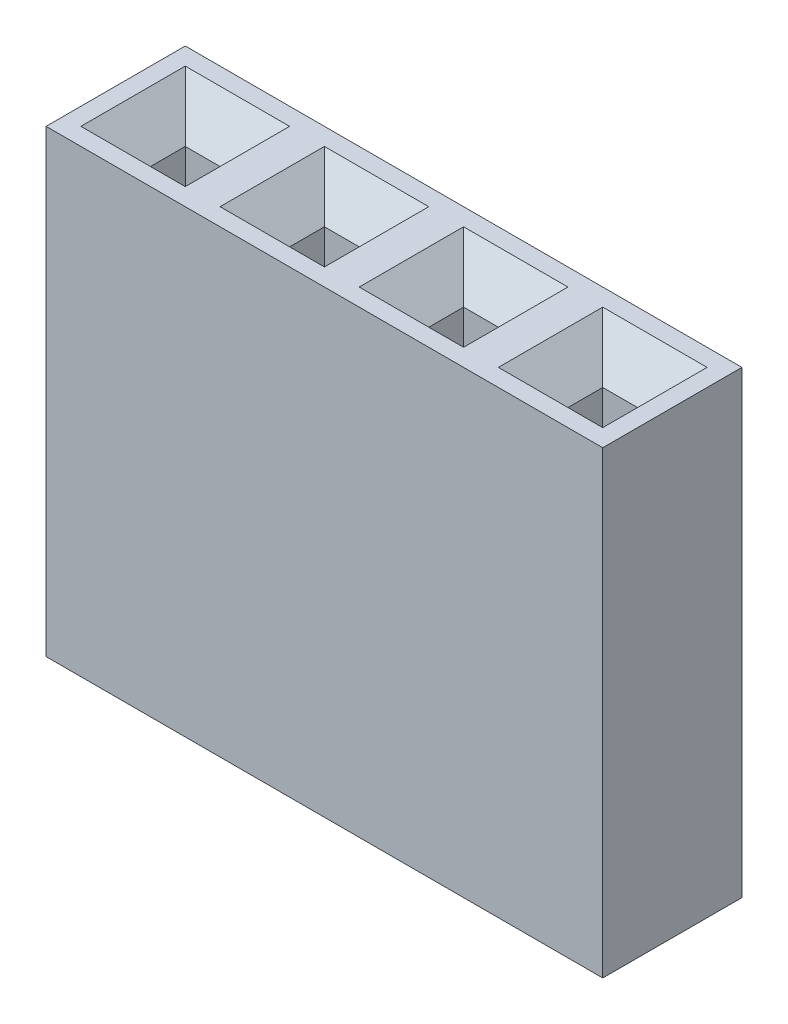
ISO-10303-21;
HEADER;
FILE_DESCRIPTION(('STEP AP214'),'2;1');
FILE_NAME('part.step','',(''),(''),'','','');
FILE_SCHEMA(('AUTOMOTIVE_DESIGN { 1 0 10303 214 1 1 1 1 }'));
ENDSEC;
DATA;
#1=APPLICATION_CONTEXT('core data for automotive mechanical design processes');
#2=APPLICATION_PROTOCOL_DEFINITION('international standard','automotive_design',2000,#1);
#3=PRODUCT_CONTEXT('',#1,'mechanical');
#4=PRODUCT('Part','Part','',(#3));
#5=PRODUCT_RELATED_PRODUCT_CATEGORY('part','',(#4));
#6=PRODUCT_DEFINITION_FORMATION('','',#4);
#7=PRODUCT_DEFINITION_CONTEXT('part definition',#1,'design');
#8=PRODUCT_DEFINITION('design','',#6,#7);
#9=PRODUCT_DEFINITION_SHAPE('','',#8);
#10=(LENGTH_UNIT() NAMED_UNIT(*) SI_UNIT(.MILLI.,.METRE.));
#11=(NAMED_UNIT(*) PLANE_ANGLE_UNIT() SI_UNIT($,.RADIAN.));
#12=(NAMED_UNIT(*) SI_UNIT($,.STERADIAN.) SOLID_ANGLE_UNIT());
#13=UNCERTAINTY_MEASURE_WITH_UNIT(LENGTH_MEASURE(1.E-05),#10,'distance_accuracy_value','');
#14=(GEOMETRIC_REPRESENTATION_CONTEXT(3) GLOBAL_UNCERTAINTY_ASSIGNED_CONTEXT((#13)) GLOBAL_UNIT_ASSIGNED_CONTEXT((#10,
#11,#12)) REPRESENTATION_CONTEXT('',''));
#15=CARTESIAN_POINT('',(0.,0.,0.));
#16=DIRECTION('',(0.,0.,1.));
#17=DIRECTION('',(1.,0.,0.));
#18=AXIS2_PLACEMENT_3D('',#15,#16,#17);
#19=CARTESIAN_POINT('',(-1.27,8.382,-1.27));
#20=DIRECTION('',(0.,-1.,0.));
#21=DIRECTION('',(0.,0.,-1.));
#22=AXIS2_PLACEMENT_3D('',#19,#20,#21);
#23=PLANE('',#22);
#24=DIRECTION('',(0.,0.,-1.));
#25=VECTOR('',#24,1.);
#26=CARTESIAN_POINT('',(-6.6675,8.382,0.9525));
#27=LINE('',#26,#25);
#28=CARTESIAN_POINT('',(-6.6675,8.382,0.9525));
#29=VERTEX_POINT('',#28);
#30=CARTESIAN_POINT('',(-6.6675,8.382,-0.9525));
#31=VERTEX_POINT('',#30);
#32=EDGE_CURVE('E67',#29,#31,#27,.T.);
#33=ORIENTED_EDGE('',*,*,#32,.F.);
#34=DIRECTION('',(1.,0.,0.));
#35=VECTOR('',#34,1.);
#36=CARTESIAN_POINT('',(-6.6675,8.382,0.9525));
#37=LINE('',#36,#35);
#38=CARTESIAN_POINT('',(-8.5725,8.382,0.9525));
#39=VERTEX_POINT('',#38);
#40=EDGE_CURVE('E260',#39,#29,#37,.T.);
#41=ORIENTED_EDGE('',*,*,#40,.F.);
#42=DIRECTION('',(0.,0.,1.));
#43=VECTOR('',#42,1.);
#44=CARTESIAN_POINT('',(-8.5725,8.382,0.9525));
#45=LINE('',#44,#43);
#46=CARTESIAN_POINT('',(-8.5725,8.382,-0.9525));
#47=VERTEX_POINT('',#46);
#48=EDGE_CURVE('E477',#47,#39,#45,.T.);
#49=ORIENTED_EDGE('',*,*,#48,.F.);
#50=DIRECTION('',(-1.,0.,0.));
#51=VECTOR('',#50,1.);
#52=CARTESIAN_POINT('',(-6.6675,8.382,-0.9525));
#53=LINE('',#52,#51);
#54=EDGE_CURVE('E358',#31,#47,#53,.T.);
#55=ORIENTED_EDGE('',*,*,#54,.F.);
#56=EDGE_LOOP('',(#33,#41,#49,#55));
#57=FACE_BOUND('',#56,.T.);
#58=DIRECTION('',(0.,0.,-1.));
#59=VECTOR('',#58,1.);
#60=CARTESIAN_POINT('',(-4.1275,8.382,0.9525));
#61=LINE('',#60,#59);
#62=CARTESIAN_POINT('',(-4.1275,8.382,0.9525));
#63=VERTEX_POINT('',#62);
#64=CARTESIAN_POINT('',(-4.1275,8.382,-0.9525));
#65=VERTEX_POINT('',#64);
#66=EDGE_CURVE('E530',#63,#65,#61,.T.);
#67=ORIENTED_EDGE('',*,*,#66,.F.);
#68=DIRECTION('',(1.,0.,0.));
#69=VECTOR('',#68,1.);
#70=CARTESIAN_POINT('',(-4.1275,8.382,0.9525));
#71=LINE('',#70,#69);
#72=CARTESIAN_POINT('',(-6.0325,8.382,0.9525));
#73=VERTEX_POINT('',#72);
#74=EDGE_CURVE('E584',#73,#63,#71,.T.);
#75=ORIENTED_EDGE('',*,*,#74,.F.);
#76=DIRECTION('',(0.,0.,1.));
#77=VECTOR('',#76,1.);
#78=CARTESIAN_POINT('',(-6.0325,8.382,0.9525));
#79=LINE('',#78,#77);
#80=CARTESIAN_POINT('',(-6.0325,8.382,-0.9525));
#81=VERTEX_POINT('',#80);
#82=EDGE_CURVE('E286',#81,#73,#79,.T.);
#83=ORIENTED_EDGE('',*,*,#82,.F.);
#84=DIRECTION('',(-1.,0.,0.));
#85=VECTOR('',#84,1.);
#86=CARTESIAN_POINT('',(-4.1275,8.382,-0.9525));
#87=LINE('',#86,#85);
#88=EDGE_CURVE('E604',#65,#81,#87,.T.);
#89=ORIENTED_EDGE('',*,*,#88,.F.);
#90=EDGE_LOOP('',(#67,#75,#83,#89));
#91=FACE_BOUND('',#90,.T.);
#92=DIRECTION('',(0.,0.,-1.));
#93=VECTOR('',#92,1.);
#94=CARTESIAN_POINT('',(-1.5875,8.382,0.9525));
#95=LINE('',#94,#93);
#96=CARTESIAN_POINT('',(-1.5875,8.382,0.9525));
#97=VERTEX_POINT('',#96);
#98=CARTESIAN_POINT('',(-1.5875,8.382,-0.9525));
#99=VERTEX_POINT('',#98);
#100=EDGE_CURVE('E737',#97,#99,#95,.T.);
#101=ORIENTED_EDGE('',*,*,#100,.F.);
#102=DIRECTION('',(1.,0.,0.));
#103=VECTOR('',#102,1.);
#104=CARTESIAN_POINT('',(-1.5875,8.382,0.9525));
#105=LINE('',#104,#103);
#106=CARTESIAN_POINT('',(-3.4925,8.382,0.9525));
#107=VERTEX_POINT('',#106);
#108=EDGE_CURVE('E788',#107,#97,#105,.T.);
#109=ORIENTED_EDGE('',*,*,#108,.F.);
#110=DIRECTION('',(0.,0.,1.));
#111=VECTOR('',#110,1.);
#112=CARTESIAN_POINT('',(-3.4925,8.382,0.9525));
#113=LINE('',#112,#111);
#114=CARTESIAN_POINT('',(-3.4925,8.382,-0.9525));
#115=VERTEX_POINT('',#114);
#116=EDGE_CURVE('E888',#115,#107,#113,.T.);
#117=ORIENTED_EDGE('',*,*,#116,.F.);
#118=DIRECTION('',(-1.,0.,0.));
#119=VECTOR('',#118,1.);
#120=CARTESIAN_POINT('',(-1.5875,8.382,-0.9525));
#121=LINE('',#120,#119);
#122=EDGE_CURVE('E808',#99,#115,#121,.T.);
#123=ORIENTED_EDGE('',*,*,#122,.F.);
#124=EDGE_LOOP('',(#101,#109,#117,#123));
#125=FACE_BOUND('',#124,.T.);
#126=DIRECTION('',(0.,0.,-1.));
#127=VECTOR('',#126,1.);
#128=CARTESIAN_POINT('',(0.9525,8.382,0.9525));
#129=LINE('',#128,#127);
#130=CARTESIAN_POINT('',(0.9525,8.382,0.9525));
#131=VERTEX_POINT('',#130);
#132=CARTESIAN_POINT('',(0.9525,8.382,-0.9525));
#133=VERTEX_POINT('',#132);
#134=EDGE_CURVE('E1049',#131,#133,#129,.T.);
#135=ORIENTED_EDGE('',*,*,#134,.F.);
#136=DIRECTION('',(1.,0.,0.));
#137=VECTOR('',#136,1.);
#138=CARTESIAN_POINT('',(0.9525,8.382,0.9525));
#139=LINE('',#138,#137);
#140=CARTESIAN_POINT('',(-0.9525,8.382,0.9525));
#141=VERTEX_POINT('',#140);
#142=EDGE_CURVE('E1057',#141,#131,#139,.T.);
#143=ORIENTED_EDGE('',*,*,#142,.F.);
#144=DIRECTION('',(0.,0.,1.));
#145=VECTOR('',#144,1.);
#146=CARTESIAN_POINT('',(-0.9525,8.382,0.9525));
#147=LINE('',#146,#145);
#148=CARTESIAN_POINT('',(-0.9525,8.382,-0.9525));
#149=VERTEX_POINT('',#148);
#150=EDGE_CURVE('E1051',#149,#141,#147,.T.);
#151=ORIENTED_EDGE('',*,*,#150,.F.);
#152=DIRECTION('',(-1.,0.,0.));
#153=VECTOR('',#152,1.);
#154=CARTESIAN_POINT('',(0.9525,8.382,-0.9525));
#155=LINE('',#154,#153);
#156=EDGE_CURVE('E1046',#133,#149,#155,.T.);
#157=ORIENTED_EDGE('',*,*,#156,.F.);
#158=EDGE_LOOP('',(#135,#143,#151,#157));
#159=FACE_BOUND('',#158,.T.);
#160=DIRECTION('',(-1.,0.,0.));
#161=VECTOR('',#160,1.);
#162=CARTESIAN_POINT('',(-1.27,8.382,-1.27));
#163=LINE('',#162,#161);
#164=CARTESIAN_POINT('',(1.27,8.382,-1.27));
#165=VERTEX_POINT('',#164);
#166=CARTESIAN_POINT('',(-8.89,8.382,-1.27));
#167=VERTEX_POINT('',#166);
#168=EDGE_CURVE('E956',#165,#167,#163,.T.);
#169=ORIENTED_EDGE('',*,*,#168,.T.);
#170=DIRECTION('',(0.,0.,1.));
#171=VECTOR('',#170,1.);
#172=CARTESIAN_POINT('',(-8.89,8.382,1.27));
#173=LINE('',#172,#171);
#174=CARTESIAN_POINT('',(-8.89,8.382,1.27));
#175=VERTEX_POINT('',#174);
#176=EDGE_CURVE('E313',#167,#175,#173,.T.);
#177=ORIENTED_EDGE('',*,*,#176,.T.);
#178=DIRECTION('',(1.,0.,0.));
#179=VECTOR('',#178,1.);
#180=CARTESIAN_POINT('',(-1.27,8.382,1.27));
#181=LINE('',#180,#179);
#182=CARTESIAN_POINT('',(1.27,8.382,1.27));
#183=VERTEX_POINT('',#182);
#184=EDGE_CURVE('E953',#175,#183,#181,.T.);
#185=ORIENTED_EDGE('',*,*,#184,.T.);
#186=DIRECTION('',(0.,0.,-1.));
#187=VECTOR('',#186,1.);
#188=CARTESIAN_POINT('',(1.27,8.382,1.27));
#189=LINE('',#188,#187);
#190=EDGE_CURVE('E960',#183,#165,#189,.T.);
#191=ORIENTED_EDGE('',*,*,#190,.T.);
#192=EDGE_LOOP('',(#169,#177,#185,#191));
#193=FACE_BOUND('',#192,.T.);
#194=ADVANCED_FACE('F63',(#57,#91,#125,#159,#193),#23,.F.);
#195=CARTESIAN_POINT('',(-1.27,0.,-1.27));
#196=DIRECTION('',(0.,-1.,0.));
#197=DIRECTION('',(0.,0.,-1.));
#198=AXIS2_PLACEMENT_3D('',#195,#196,#197);
#199=PLANE('',#198);
#200=DIRECTION('',(1.,0.,0.));
#201=VECTOR('',#200,1.);
#202=CARTESIAN_POINT('',(-1.27,0.,1.27));
#203=LINE('',#202,#201);
#204=CARTESIAN_POINT('',(-8.89,0.,1.27));
#205=VERTEX_POINT('',#204);
#206=CARTESIAN_POINT('',(1.27,0.,1.27));
#207=VERTEX_POINT('',#206);
#208=EDGE_CURVE('E925',#205,#207,#203,.T.);
#209=ORIENTED_EDGE('',*,*,#208,.F.);
#210=DIRECTION('',(0.,0.,1.));
#211=VECTOR('',#210,1.);
#212=CARTESIAN_POINT('',(-8.89,0.,1.27));
#213=LINE('',#212,#211);
#214=CARTESIAN_POINT('',(-8.89,0.,-1.27));
#215=VERTEX_POINT('',#214);
#216=EDGE_CURVE('E296',#215,#205,#213,.T.);
#217=ORIENTED_EDGE('',*,*,#216,.F.);
#218=DIRECTION('',(-1.,0.,0.));
#219=VECTOR('',#218,1.);
#220=CARTESIAN_POINT('',(-1.27,0.,-1.27));
#221=LINE('',#220,#219);
#222=CARTESIAN_POINT('',(1.27,0.,-1.27));
#223=VERTEX_POINT('',#222);
#224=EDGE_CURVE('E961',#223,#215,#221,.T.);
#225=ORIENTED_EDGE('',*,*,#224,.F.);
#226=DIRECTION('',(0.,0.,-1.));
#227=VECTOR('',#226,1.);
#228=CARTESIAN_POINT('',(1.27,0.,1.27));
#229=LINE('',#228,#227);
#230=EDGE_CURVE('E964',#207,#223,#229,.T.);
#231=ORIENTED_EDGE('',*,*,#230,.F.);
#232=EDGE_LOOP('',(#209,#217,#225,#231));
#233=FACE_BOUND('',#232,.T.);
#234=DIRECTION('',(-1.,0.,0.));
#235=VECTOR('',#234,1.);
#236=CARTESIAN_POINT('',(-0.3175,0.,-0.3175));
#237=LINE('',#236,#235);
#238=CARTESIAN_POINT('',(0.3175,0.,-0.3175));
#239=VERTEX_POINT('',#238);
#240=CARTESIAN_POINT('',(-0.3175,0.,-0.3175));
#241=VERTEX_POINT('',#240);
#242=EDGE_CURVE('E932',#239,#241,#237,.T.);
#243=ORIENTED_EDGE('',*,*,#242,.T.);
#244=DIRECTION('',(0.,0.,1.));
#245=VECTOR('',#244,1.);
#246=CARTESIAN_POINT('',(-0.3175,0.,0.3175));
#247=LINE('',#246,#245);
#248=CARTESIAN_POINT('',(-0.3175,0.,0.3175));
#249=VERTEX_POINT('',#248);
#250=EDGE_CURVE('E1069',#241,#249,#247,.T.);
#251=ORIENTED_EDGE('',*,*,#250,.T.);
#252=DIRECTION('',(1.,0.,0.));
#253=VECTOR('',#252,1.);
#254=CARTESIAN_POINT('',(-0.3175,0.,0.3175));
#255=LINE('',#254,#253);
#256=CARTESIAN_POINT('',(0.3175,0.,0.3175));
#257=VERTEX_POINT('',#256);
#258=EDGE_CURVE('E1071',#249,#257,#255,.T.);
#259=ORIENTED_EDGE('',*,*,#258,.T.);
#260=DIRECTION('',(0.,0.,-1.));
#261=VECTOR('',#260,1.);
#262=CARTESIAN_POINT('',(0.3175,0.,0.3175));
#263=LINE('',#262,#261);
#264=EDGE_CURVE('E1075',#257,#239,#263,.T.);
#265=ORIENTED_EDGE('',*,*,#264,.T.);
#266=EDGE_LOOP('',(#243,#251,#259,#265));
#267=FACE_BOUND('',#266,.T.);
#268=DIRECTION('',(-1.,0.,0.));
#269=VECTOR('',#268,1.);
#270=CARTESIAN_POINT('',(-2.8575,0.,-0.3175));
#271=LINE('',#270,#269);
#272=CARTESIAN_POINT('',(-2.2225,0.,-0.3175));
#273=VERTEX_POINT('',#272);
#274=CARTESIAN_POINT('',(-2.8575,0.,-0.3175));
#275=VERTEX_POINT('',#274);
#276=EDGE_CURVE('E824',#273,#275,#271,.T.);
#277=ORIENTED_EDGE('',*,*,#276,.T.);
#278=DIRECTION('',(0.,0.,1.));
#279=VECTOR('',#278,1.);
#280=CARTESIAN_POINT('',(-2.8575,0.,0.3175));
#281=LINE('',#280,#279);
#282=CARTESIAN_POINT('',(-2.8575,0.,0.3175));
#283=VERTEX_POINT('',#282);
#284=EDGE_CURVE('E822',#275,#283,#281,.T.);
#285=ORIENTED_EDGE('',*,*,#284,.T.);
#286=DIRECTION('',(1.,0.,0.));
#287=VECTOR('',#286,1.);
#288=CARTESIAN_POINT('',(-2.8575,0.,0.3175));
#289=LINE('',#288,#287);
#290=CARTESIAN_POINT('',(-2.2225,0.,0.3175));
#291=VERTEX_POINT('',#290);
#292=EDGE_CURVE('E1555',#283,#291,#289,.T.);
#293=ORIENTED_EDGE('',*,*,#292,.T.);
#294=DIRECTION('',(0.,0.,-1.));
#295=VECTOR('',#294,1.);
#296=CARTESIAN_POINT('',(-2.2225,0.,0.3175));
#297=LINE('',#296,#295);
#298=EDGE_CURVE('E827',#291,#273,#297,.T.);
#299=ORIENTED_EDGE('',*,*,#298,.T.);
#300=EDGE_LOOP('',(#277,#285,#293,#299));
#301=FACE_BOUND('',#300,.T.);
#302=DIRECTION('',(-1.,0.,0.));
#303=VECTOR('',#302,1.);
#304=CARTESIAN_POINT('',(-5.3975,0.,-0.3175));
#305=LINE('',#304,#303);
#306=CARTESIAN_POINT('',(-4.7625,0.,-0.3175));
#307=VERTEX_POINT('',#306);
#308=CARTESIAN_POINT('',(-5.3975,0.,-0.3175));
#309=VERTEX_POINT('',#308);
#310=EDGE_CURVE('E620',#307,#309,#305,.T.);
#311=ORIENTED_EDGE('',*,*,#310,.T.);
#312=DIRECTION('',(0.,0.,1.));
#313=VECTOR('',#312,1.);
#314=CARTESIAN_POINT('',(-5.3975,0.,0.3175));
#315=LINE('',#314,#313);
#316=CARTESIAN_POINT('',(-5.3975,0.,0.3175));
#317=VERTEX_POINT('',#316);
#318=EDGE_CURVE('E618',#309,#317,#315,.T.);
#319=ORIENTED_EDGE('',*,*,#318,.T.);
#320=DIRECTION('',(1.,0.,0.));
#321=VECTOR('',#320,1.);
#322=CARTESIAN_POINT('',(-5.3975,0.,0.3175));
#323=LINE('',#322,#321);
#324=CARTESIAN_POINT('',(-4.7625,0.,0.3175));
#325=VERTEX_POINT('',#324);
#326=EDGE_CURVE('E939',#317,#325,#323,.T.);
#327=ORIENTED_EDGE('',*,*,#326,.T.);
#328=DIRECTION('',(0.,0.,-1.));
#329=VECTOR('',#328,1.);
#330=CARTESIAN_POINT('',(-4.7625,0.,0.3175));
#331=LINE('',#330,#329);
#332=EDGE_CURVE('E623',#325,#307,#331,.T.);
#333=ORIENTED_EDGE('',*,*,#332,.T.);
#334=EDGE_LOOP('',(#311,#319,#327,#333));
#335=FACE_BOUND('',#334,.T.);
#336=DIRECTION('',(-1.,0.,0.));
#337=VECTOR('',#336,1.);
#338=CARTESIAN_POINT('',(-7.9375,0.,-0.3175));
#339=LINE('',#338,#337);
#340=CARTESIAN_POINT('',(-7.3025,0.,-0.3175));
#341=VERTEX_POINT('',#340);
#342=CARTESIAN_POINT('',(-7.9375,0.,-0.3175));
#343=VERTEX_POINT('',#342);
#344=EDGE_CURVE('E906',#341,#343,#339,.T.);
#345=ORIENTED_EDGE('',*,*,#344,.T.);
#346=DIRECTION('',(0.,0.,1.));
#347=VECTOR('',#346,1.);
#348=CARTESIAN_POINT('',(-7.9375,0.,0.3175));
#349=LINE('',#348,#347);
#350=CARTESIAN_POINT('',(-7.9375,0.,0.3175));
#351=VERTEX_POINT('',#350);
#352=EDGE_CURVE('E900',#343,#351,#349,.T.);
#353=ORIENTED_EDGE('',*,*,#352,.T.);
#354=DIRECTION('',(1.,0.,0.));
#355=VECTOR('',#354,1.);
#356=CARTESIAN_POINT('',(-7.9375,0.,0.3175));
#357=LINE('',#356,#355);
#358=CARTESIAN_POINT('',(-7.3025,0.,0.3175));
#359=VERTEX_POINT('',#358);
#360=EDGE_CURVE('E903',#351,#359,#357,.T.);
#361=ORIENTED_EDGE('',*,*,#360,.T.);
#362=DIRECTION('',(0.,0.,-1.));
#363=VECTOR('',#362,1.);
#364=CARTESIAN_POINT('',(-7.3025,0.,0.3175));
#365=LINE('',#364,#363);
#366=EDGE_CURVE('E292',#359,#341,#365,.T.);
#367=ORIENTED_EDGE('',*,*,#366,.T.);
#368=EDGE_LOOP('',(#345,#353,#361,#367));
#369=FACE_BOUND('',#368,.T.);
#370=ADVANCED_FACE('F373',(#233,#267,#301,#335,#369),#199,.T.);
#371=CARTESIAN_POINT('',(-1.27,8.382,1.27));
#372=DIRECTION('',(0.,0.,-1.));
#373=DIRECTION('',(-1.,0.,0.));
#374=AXIS2_PLACEMENT_3D('',#371,#372,#373);
#375=PLANE('',#374);
#376=ORIENTED_EDGE('',*,*,#208,.T.);
#377=DIRECTION('',(0.,-1.,0.));
#378=VECTOR('',#377,1.);
#379=CARTESIAN_POINT('',(1.27,8.382,1.27));
#380=LINE('',#379,#378);
#381=EDGE_CURVE('E12',#183,#207,#380,.T.);
#382=ORIENTED_EDGE('',*,*,#381,.F.);
#383=ORIENTED_EDGE('',*,*,#184,.F.);
#384=DIRECTION('',(0.,-1.,0.));
#385=VECTOR('',#384,1.);
#386=CARTESIAN_POINT('',(-8.89,8.382,1.27));
#387=LINE('',#386,#385);
#388=EDGE_CURVE('E943',#175,#205,#387,.T.);
#389=ORIENTED_EDGE('',*,*,#388,.T.);
#390=EDGE_LOOP('',(#376,#382,#383,#389));
#391=FACE_BOUND('',#390,.T.);
#392=ADVANCED_FACE('F65',(#391),#375,.F.);
#393=CARTESIAN_POINT('',(1.27,8.382,1.27));
#394=DIRECTION('',(-1.,0.,0.));
#395=DIRECTION('',(0.,0.,1.));
#396=AXIS2_PLACEMENT_3D('',#393,#394,#395);
#397=PLANE('',#396);
#398=ORIENTED_EDGE('',*,*,#230,.T.);
#399=DIRECTION('',(0.,-1.,0.));
#400=VECTOR('',#399,1.);
#401=CARTESIAN_POINT('',(1.27,8.382,-1.27));
#402=LINE('',#401,#400);
#403=EDGE_CURVE('E73',#165,#223,#402,.T.);
#404=ORIENTED_EDGE('',*,*,#403,.F.);
#405=ORIENTED_EDGE('',*,*,#190,.F.);
#406=ORIENTED_EDGE('',*,*,#381,.T.);
#407=EDGE_LOOP('',(#398,#404,#405,#406));
#408=FACE_BOUND('',#407,.T.);
#409=ADVANCED_FACE('F920',(#408),#397,.F.);
#410=CARTESIAN_POINT('',(-1.27,8.382,-1.27));
#411=DIRECTION('',(0.,0.,1.));
#412=DIRECTION('',(1.,0.,0.));
#413=AXIS2_PLACEMENT_3D('',#410,#411,#412);
#414=PLANE('',#413);
#415=ORIENTED_EDGE('',*,*,#224,.T.);
#416=DIRECTION('',(0.,-1.,0.));
#417=VECTOR('',#416,1.);
#418=CARTESIAN_POINT('',(-8.89,8.382,-1.27));
#419=LINE('',#418,#417);
#420=EDGE_CURVE('E945',#167,#215,#419,.T.);
#421=ORIENTED_EDGE('',*,*,#420,.F.);
#422=ORIENTED_EDGE('',*,*,#168,.F.);
#423=ORIENTED_EDGE('',*,*,#403,.T.);
#424=EDGE_LOOP('',(#415,#421,#422,#423));
#425=FACE_BOUND('',#424,.T.);
#426=ADVANCED_FACE('F1233',(#425),#414,.F.);
#427=CARTESIAN_POINT('',(-0.3175,8.382,0.3175));
#428=DIRECTION('',(1.,0.,0.));
#429=DIRECTION('',(0.,0.,-1.));
#430=AXIS2_PLACEMENT_3D('',#427,#428,#429);
#431=PLANE('',#430);
#432=DIRECTION('',(0.,0.,1.));
#433=VECTOR('',#432,1.);
#434=CARTESIAN_POINT('',(-0.3175,7.747,0.3175));
#435=LINE('',#434,#433);
#436=CARTESIAN_POINT('',(-0.3175,7.747,-0.3175));
#437=VERTEX_POINT('',#436);
#438=CARTESIAN_POINT('',(-0.3175,7.747,0.3175));
#439=VERTEX_POINT('',#438);
#440=EDGE_CURVE('E1034',#437,#439,#435,.T.);
#441=ORIENTED_EDGE('',*,*,#440,.T.);
#442=DIRECTION('',(0.,-1.,0.));
#443=VECTOR('',#442,1.);
#444=CARTESIAN_POINT('',(-0.3175,8.382,0.3175));
#445=LINE('',#444,#443);
#446=EDGE_CURVE('E972',#439,#249,#445,.T.);
#447=ORIENTED_EDGE('',*,*,#446,.T.);
#448=ORIENTED_EDGE('',*,*,#250,.F.);
#449=DIRECTION('',(0.,-1.,0.));
#450=VECTOR('',#449,1.);
#451=CARTESIAN_POINT('',(-0.3175,8.382,-0.3175));
#452=LINE('',#451,#450);
#453=EDGE_CURVE('E980',#437,#241,#452,.T.);
#454=ORIENTED_EDGE('',*,*,#453,.F.);
#455=EDGE_LOOP('',(#441,#447,#448,#454));
#456=FACE_BOUND('',#455,.T.);
#457=ADVANCED_FACE('F374',(#456),#431,.T.);
#458=CARTESIAN_POINT('',(-0.3175,8.382,0.3175));
#459=DIRECTION('',(0.,0.,-1.));
#460=DIRECTION('',(-1.,0.,0.));
#461=AXIS2_PLACEMENT_3D('',#458,#459,#460);
#462=PLANE('',#461);
#463=DIRECTION('',(1.,0.,0.));
#464=VECTOR('',#463,1.);
#465=CARTESIAN_POINT('',(0.3175,7.747,0.3175));
#466=LINE('',#465,#464);
#467=CARTESIAN_POINT('',(0.3175,7.747,0.3175));
#468=VERTEX_POINT('',#467);
#469=EDGE_CURVE('E1072',#439,#468,#466,.T.);
#470=ORIENTED_EDGE('',*,*,#469,.T.);
#471=DIRECTION('',(0.,-1.,0.));
#472=VECTOR('',#471,1.);
#473=CARTESIAN_POINT('',(0.3175,8.382,0.3175));
#474=LINE('',#473,#472);
#475=EDGE_CURVE('E979',#468,#257,#474,.T.);
#476=ORIENTED_EDGE('',*,*,#475,.T.);
#477=ORIENTED_EDGE('',*,*,#258,.F.);
#478=ORIENTED_EDGE('',*,*,#446,.F.);
#479=EDGE_LOOP('',(#470,#476,#477,#478));
#480=FACE_BOUND('',#479,.T.);
#481=ADVANCED_FACE('F1014',(#480),#462,.T.);
#482=CARTESIAN_POINT('',(0.3175,8.382,0.3175));
#483=DIRECTION('',(-1.,0.,0.));
#484=DIRECTION('',(0.,0.,1.));
#485=AXIS2_PLACEMENT_3D('',#482,#483,#484);
#486=PLANE('',#485);
#487=DIRECTION('',(0.,0.,-1.));
#488=VECTOR('',#487,1.);
#489=CARTESIAN_POINT('',(0.3175,7.747,0.3175));
#490=LINE('',#489,#488);
#491=CARTESIAN_POINT('',(0.3175,7.747,-0.3175));
#492=VERTEX_POINT('',#491);
#493=EDGE_CURVE('E998',#468,#492,#490,.T.);
#494=ORIENTED_EDGE('',*,*,#493,.T.);
#495=DIRECTION('',(0.,-1.,0.));
#496=VECTOR('',#495,1.);
#497=CARTESIAN_POINT('',(0.3175,8.382,-0.3175));
#498=LINE('',#497,#496);
#499=EDGE_CURVE('E976',#492,#239,#498,.T.);
#500=ORIENTED_EDGE('',*,*,#499,.T.);
#501=ORIENTED_EDGE('',*,*,#264,.F.);
#502=ORIENTED_EDGE('',*,*,#475,.F.);
#503=EDGE_LOOP('',(#494,#500,#501,#502));
#504=FACE_BOUND('',#503,.T.);
#505=ADVANCED_FACE('F1005',(#504),#486,.T.);
#506=CARTESIAN_POINT('',(-0.3175,8.382,-0.3175));
#507=DIRECTION('',(0.,0.,1.));
#508=DIRECTION('',(1.,0.,0.));
#509=AXIS2_PLACEMENT_3D('',#506,#507,#508);
#510=PLANE('',#509);
#511=DIRECTION('',(-1.,0.,0.));
#512=VECTOR('',#511,1.);
#513=CARTESIAN_POINT('',(0.3175,7.747,-0.3175));
#514=LINE('',#513,#512);
#515=EDGE_CURVE('E1080',#492,#437,#514,.T.);
#516=ORIENTED_EDGE('',*,*,#515,.T.);
#517=ORIENTED_EDGE('',*,*,#453,.T.);
#518=ORIENTED_EDGE('',*,*,#242,.F.);
#519=ORIENTED_EDGE('',*,*,#499,.F.);
#520=EDGE_LOOP('',(#516,#517,#518,#519));
#521=FACE_BOUND('',#520,.T.);
#522=ADVANCED_FACE('F1013',(#521),#510,.T.);
#523=CARTESIAN_POINT('',(0.,7.4295,0.));
#524=DIRECTION('',(0.,-0.707106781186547,0.707106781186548));
#525=DIRECTION('',(0.,-0.707106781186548,-0.707106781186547));
#526=AXIS2_PLACEMENT_3D('',#523,#524,#525);
#527=PLANE('',#526);
#528=DIRECTION('',(0.577350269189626,0.577350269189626,0.577350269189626));
#529=VECTOR('',#528,1.);
#530=CARTESIAN_POINT('',(0.3175,7.747,0.3175));
#531=LINE('',#530,#529);
#532=EDGE_CURVE('E1101',#468,#131,#531,.T.);
#533=ORIENTED_EDGE('',*,*,#532,.F.);
#534=ORIENTED_EDGE('',*,*,#469,.F.);
#535=DIRECTION('',(-0.577350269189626,0.577350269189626,0.577350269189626));
#536=VECTOR('',#535,1.);
#537=CARTESIAN_POINT('',(-0.3175,7.747,0.3175));
#538=LINE('',#537,#536);
#539=EDGE_CURVE('E1100',#439,#141,#538,.T.);
#540=ORIENTED_EDGE('',*,*,#539,.T.);
#541=ORIENTED_EDGE('',*,*,#142,.T.);
#542=EDGE_LOOP('',(#533,#534,#540,#541));
#543=FACE_BOUND('',#542,.T.);
#544=ADVANCED_FACE('F1173',(#543),#527,.F.);
#545=CARTESIAN_POINT('',(0.,7.4295,0.));
#546=DIRECTION('',(-0.707106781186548,-0.707106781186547,0.));
#547=DIRECTION('',(0.707106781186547,-0.707106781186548,0.));
#548=AXIS2_PLACEMENT_3D('',#545,#546,#547);
#549=PLANE('',#548);
#550=ORIENTED_EDGE('',*,*,#539,.F.);
#551=ORIENTED_EDGE('',*,*,#440,.F.);
#552=DIRECTION('',(-0.577350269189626,0.577350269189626,-0.577350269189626));
#553=VECTOR('',#552,1.);
#554=CARTESIAN_POINT('',(-0.3175,7.747,-0.3175));
#555=LINE('',#554,#553);
#556=EDGE_CURVE('E1153',#437,#149,#555,.T.);
#557=ORIENTED_EDGE('',*,*,#556,.T.);
#558=ORIENTED_EDGE('',*,*,#150,.T.);
#559=EDGE_LOOP('',(#550,#551,#557,#558));
#560=FACE_BOUND('',#559,.T.);
#561=ADVANCED_FACE('F1130',(#560),#549,.F.);
#562=CARTESIAN_POINT('',(0.,7.4295,0.));
#563=DIRECTION('',(0.707106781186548,-0.707106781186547,0.));
#564=DIRECTION('',(0.707106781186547,0.707106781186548,0.));
#565=AXIS2_PLACEMENT_3D('',#562,#563,#564);
#566=PLANE('',#565);
#567=DIRECTION('',(0.577350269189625,0.577350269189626,-0.577350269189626));
#568=VECTOR('',#567,1.);
#569=CARTESIAN_POINT('',(0.3175,7.747,-0.3175));
#570=LINE('',#569,#568);
#571=EDGE_CURVE('E1104',#492,#133,#570,.T.);
#572=ORIENTED_EDGE('',*,*,#571,.F.);
#573=ORIENTED_EDGE('',*,*,#493,.F.);
#574=ORIENTED_EDGE('',*,*,#532,.T.);
#575=ORIENTED_EDGE('',*,*,#134,.T.);
#576=EDGE_LOOP('',(#572,#573,#574,#575));
#577=FACE_BOUND('',#576,.T.);
#578=ADVANCED_FACE('F1121',(#577),#566,.F.);
#579=CARTESIAN_POINT('',(0.,7.4295,0.));
#580=DIRECTION('',(0.,-0.707106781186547,-0.707106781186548));
#581=DIRECTION('',(0.,0.707106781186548,-0.707106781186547));
#582=AXIS2_PLACEMENT_3D('',#579,#580,#581);
#583=PLANE('',#582);
#584=ORIENTED_EDGE('',*,*,#556,.F.);
#585=ORIENTED_EDGE('',*,*,#515,.F.);
#586=ORIENTED_EDGE('',*,*,#571,.T.);
#587=ORIENTED_EDGE('',*,*,#156,.T.);
#588=EDGE_LOOP('',(#584,#585,#586,#587));
#589=FACE_BOUND('',#588,.T.);
#590=ADVANCED_FACE('F1129',(#589),#583,.F.);
#591=CARTESIAN_POINT('',(-2.8575,8.382,0.3175));
#592=DIRECTION('',(1.,0.,0.));
#593=DIRECTION('',(0.,0.,-1.));
#594=AXIS2_PLACEMENT_3D('',#591,#592,#593);
#595=PLANE('',#594);
#596=DIRECTION('',(0.,0.,1.));
#597=VECTOR('',#596,1.);
#598=CARTESIAN_POINT('',(-2.8575,7.747,0.3175));
#599=LINE('',#598,#597);
#600=CARTESIAN_POINT('',(-2.8575,7.747,-0.3175));
#601=VERTEX_POINT('',#600);
#602=CARTESIAN_POINT('',(-2.8575,7.747,0.3175));
#603=VERTEX_POINT('',#602);
#604=EDGE_CURVE('E793',#601,#603,#599,.T.);
#605=ORIENTED_EDGE('',*,*,#604,.T.);
#606=DIRECTION('',(0.,-1.,0.));
#607=VECTOR('',#606,1.);
#608=CARTESIAN_POINT('',(-2.8575,8.382,0.3175));
#609=LINE('',#608,#607);
#610=EDGE_CURVE('E842',#603,#283,#609,.T.);
#611=ORIENTED_EDGE('',*,*,#610,.T.);
#612=ORIENTED_EDGE('',*,*,#284,.F.);
#613=DIRECTION('',(0.,-1.,0.));
#614=VECTOR('',#613,1.);
#615=CARTESIAN_POINT('',(-2.8575,8.382,-0.3175));
#616=LINE('',#615,#614);
#617=EDGE_CURVE('E814',#601,#275,#616,.T.);
#618=ORIENTED_EDGE('',*,*,#617,.F.);
#619=EDGE_LOOP('',(#605,#611,#612,#618));
#620=FACE_BOUND('',#619,.T.);
#621=ADVANCED_FACE('F820',(#620),#595,.T.);
#622=CARTESIAN_POINT('',(-2.8575,8.382,0.3175));
#623=DIRECTION('',(0.,0.,-1.));
#624=DIRECTION('',(-1.,0.,0.));
#625=AXIS2_PLACEMENT_3D('',#622,#623,#624);
#626=PLANE('',#625);
#627=DIRECTION('',(1.,0.,0.));
#628=VECTOR('',#627,1.);
#629=CARTESIAN_POINT('',(-2.2225,7.747,0.3175));
#630=LINE('',#629,#628);
#631=CARTESIAN_POINT('',(-2.2225,7.747,0.3175));
#632=VERTEX_POINT('',#631);
#633=EDGE_CURVE('E701',#603,#632,#630,.T.);
#634=ORIENTED_EDGE('',*,*,#633,.T.);
#635=DIRECTION('',(0.,-1.,0.));
#636=VECTOR('',#635,1.);
#637=CARTESIAN_POINT('',(-2.2225,8.382,0.3175));
#638=LINE('',#637,#636);
#639=EDGE_CURVE('E825',#632,#291,#638,.T.);
#640=ORIENTED_EDGE('',*,*,#639,.T.);
#641=ORIENTED_EDGE('',*,*,#292,.F.);
#642=ORIENTED_EDGE('',*,*,#610,.F.);
#643=EDGE_LOOP('',(#634,#640,#641,#642));
#644=FACE_BOUND('',#643,.T.);
#645=ADVANCED_FACE('F862',(#644),#626,.T.);
#646=CARTESIAN_POINT('',(-2.2225,8.382,0.3175));
#647=DIRECTION('',(-1.,0.,0.));
#648=DIRECTION('',(0.,0.,1.));
#649=AXIS2_PLACEMENT_3D('',#646,#647,#648);
#650=PLANE('',#649);
#651=DIRECTION('',(0.,0.,-1.));
#652=VECTOR('',#651,1.);
#653=CARTESIAN_POINT('',(-2.2225,7.747,0.3175));
#654=LINE('',#653,#652);
#655=CARTESIAN_POINT('',(-2.2225,7.747,-0.3175));
#656=VERTEX_POINT('',#655);
#657=EDGE_CURVE('E817',#632,#656,#654,.T.);
#658=ORIENTED_EDGE('',*,*,#657,.T.);
#659=DIRECTION('',(0.,-1.,0.));
#660=VECTOR('',#659,1.);
#661=CARTESIAN_POINT('',(-2.2225,8.382,-0.3175));
#662=LINE('',#661,#660);
#663=EDGE_CURVE('E816',#656,#273,#662,.T.);
#664=ORIENTED_EDGE('',*,*,#663,.T.);
#665=ORIENTED_EDGE('',*,*,#298,.F.);
#666=ORIENTED_EDGE('',*,*,#639,.F.);
#667=EDGE_LOOP('',(#658,#664,#665,#666));
#668=FACE_BOUND('',#667,.T.);
#669=ADVANCED_FACE('F853',(#668),#650,.T.);
#670=CARTESIAN_POINT('',(-2.8575,8.382,-0.3175));
#671=DIRECTION('',(0.,0.,1.));
#672=DIRECTION('',(1.,0.,0.));
#673=AXIS2_PLACEMENT_3D('',#670,#671,#672);
#674=PLANE('',#673);
#675=DIRECTION('',(-1.,0.,0.));
#676=VECTOR('',#675,1.);
#677=CARTESIAN_POINT('',(-2.2225,7.747,-0.3175));
#678=LINE('',#677,#676);
#679=EDGE_CURVE('E776',#656,#601,#678,.T.);
#680=ORIENTED_EDGE('',*,*,#679,.T.);
#681=ORIENTED_EDGE('',*,*,#617,.T.);
#682=ORIENTED_EDGE('',*,*,#276,.F.);
#683=ORIENTED_EDGE('',*,*,#663,.F.);
#684=EDGE_LOOP('',(#680,#681,#682,#683));
#685=FACE_BOUND('',#684,.T.);
#686=ADVANCED_FACE('F812',(#685),#674,.T.);
#687=CARTESIAN_POINT('',(-5.3975,8.382,0.3175));
#688=DIRECTION('',(1.,0.,0.));
#689=DIRECTION('',(0.,0.,-1.));
#690=AXIS2_PLACEMENT_3D('',#687,#688,#689);
#691=PLANE('',#690);
#692=DIRECTION('',(0.,0.,1.));
#693=VECTOR('',#692,1.);
#694=CARTESIAN_POINT('',(-5.3975,7.747,0.3175));
#695=LINE('',#694,#693);
#696=CARTESIAN_POINT('',(-5.3975,7.747,-0.3175));
#697=VERTEX_POINT('',#696);
#698=CARTESIAN_POINT('',(-5.3975,7.747,0.3175));
#699=VERTEX_POINT('',#698);
#700=EDGE_CURVE('E589',#697,#699,#695,.T.);
#701=ORIENTED_EDGE('',*,*,#700,.T.);
#702=DIRECTION('',(0.,-1.,0.));
#703=VECTOR('',#702,1.);
#704=CARTESIAN_POINT('',(-5.3975,8.382,0.3175));
#705=LINE('',#704,#703);
#706=EDGE_CURVE('E638',#699,#317,#705,.T.);
#707=ORIENTED_EDGE('',*,*,#706,.T.);
#708=ORIENTED_EDGE('',*,*,#318,.F.);
#709=DIRECTION('',(0.,-1.,0.));
#710=VECTOR('',#709,1.);
#711=CARTESIAN_POINT('',(-5.3975,8.382,-0.3175));
#712=LINE('',#711,#710);
#713=EDGE_CURVE('E610',#697,#309,#712,.T.);
#714=ORIENTED_EDGE('',*,*,#713,.F.);
#715=EDGE_LOOP('',(#701,#707,#708,#714));
#716=FACE_BOUND('',#715,.T.);
#717=ADVANCED_FACE('F616',(#716),#691,.T.);
#718=CARTESIAN_POINT('',(-5.3975,8.382,0.3175));
#719=DIRECTION('',(0.,0.,-1.));
#720=DIRECTION('',(-1.,0.,0.));
#721=AXIS2_PLACEMENT_3D('',#718,#719,#720);
#722=PLANE('',#721);
#723=DIRECTION('',(1.,0.,0.));
#724=VECTOR('',#723,1.);
#725=CARTESIAN_POINT('',(-4.7625,7.747,0.3175));
#726=LINE('',#725,#724);
#727=CARTESIAN_POINT('',(-4.7625,7.747,0.3175));
#728=VERTEX_POINT('',#727);
#729=EDGE_CURVE('E488',#699,#728,#726,.T.);
#730=ORIENTED_EDGE('',*,*,#729,.T.);
#731=DIRECTION('',(0.,-1.,0.));
#732=VECTOR('',#731,1.);
#733=CARTESIAN_POINT('',(-4.7625,8.382,0.3175));
#734=LINE('',#733,#732);
#735=EDGE_CURVE('E621',#728,#325,#734,.T.);
#736=ORIENTED_EDGE('',*,*,#735,.T.);
#737=ORIENTED_EDGE('',*,*,#326,.F.);
#738=ORIENTED_EDGE('',*,*,#706,.F.);
#739=EDGE_LOOP('',(#730,#736,#737,#738));
#740=FACE_BOUND('',#739,.T.);
#741=ADVANCED_FACE('F659',(#740),#722,.T.);
#742=CARTESIAN_POINT('',(-4.7625,8.382,0.3175));
#743=DIRECTION('',(-1.,0.,0.));
#744=DIRECTION('',(0.,0.,1.));
#745=AXIS2_PLACEMENT_3D('',#742,#743,#744);
#746=PLANE('',#745);
#747=DIRECTION('',(0.,0.,-1.));
#748=VECTOR('',#747,1.);
#749=CARTESIAN_POINT('',(-4.7625,7.747,0.3175));
#750=LINE('',#749,#748);
#751=CARTESIAN_POINT('',(-4.7625,7.747,-0.3175));
#752=VERTEX_POINT('',#751);
#753=EDGE_CURVE('E613',#728,#752,#750,.T.);
#754=ORIENTED_EDGE('',*,*,#753,.T.);
#755=DIRECTION('',(0.,-1.,0.));
#756=VECTOR('',#755,1.);
#757=CARTESIAN_POINT('',(-4.7625,8.382,-0.3175));
#758=LINE('',#757,#756);
#759=EDGE_CURVE('E612',#752,#307,#758,.T.);
#760=ORIENTED_EDGE('',*,*,#759,.T.);
#761=ORIENTED_EDGE('',*,*,#332,.F.);
#762=ORIENTED_EDGE('',*,*,#735,.F.);
#763=EDGE_LOOP('',(#754,#760,#761,#762));
#764=FACE_BOUND('',#763,.T.);
#765=ADVANCED_FACE('F650',(#764),#746,.T.);
#766=CARTESIAN_POINT('',(-5.3975,8.382,-0.3175));
#767=DIRECTION('',(0.,0.,1.));
#768=DIRECTION('',(1.,0.,0.));
#769=AXIS2_PLACEMENT_3D('',#766,#767,#768);
#770=PLANE('',#769);
#771=DIRECTION('',(-1.,0.,0.));
#772=VECTOR('',#771,1.);
#773=CARTESIAN_POINT('',(-4.7625,7.747,-0.3175));
#774=LINE('',#773,#772);
#775=EDGE_CURVE('E572',#752,#697,#774,.T.);
#776=ORIENTED_EDGE('',*,*,#775,.T.);
#777=ORIENTED_EDGE('',*,*,#713,.T.);
#778=ORIENTED_EDGE('',*,*,#310,.F.);
#779=ORIENTED_EDGE('',*,*,#759,.F.);
#780=EDGE_LOOP('',(#776,#777,#778,#779));
#781=FACE_BOUND('',#780,.T.);
#782=ADVANCED_FACE('F608',(#781),#770,.T.);
#783=CARTESIAN_POINT('',(-8.89,8.382,1.27));
#784=DIRECTION('',(1.,0.,0.));
#785=DIRECTION('',(0.,0.,-1.));
#786=AXIS2_PLACEMENT_3D('',#783,#784,#785);
#787=PLANE('',#786);
#788=ORIENTED_EDGE('',*,*,#216,.T.);
#789=ORIENTED_EDGE('',*,*,#388,.F.);
#790=ORIENTED_EDGE('',*,*,#176,.F.);
#791=ORIENTED_EDGE('',*,*,#420,.T.);
#792=EDGE_LOOP('',(#788,#789,#790,#791));
#793=FACE_BOUND('',#792,.T.);
#794=ADVANCED_FACE('F958',(#793),#787,.F.);
#795=CARTESIAN_POINT('',(-7.9375,8.382,0.3175));
#796=DIRECTION('',(1.,0.,0.));
#797=DIRECTION('',(0.,0.,-1.));
#798=AXIS2_PLACEMENT_3D('',#795,#796,#797);
#799=PLANE('',#798);
#800=DIRECTION('',(0.,0.,1.));
#801=VECTOR('',#800,1.);
#802=CARTESIAN_POINT('',(-7.9375,7.747,0.3175));
#803=LINE('',#802,#801);
#804=CARTESIAN_POINT('',(-7.9375,7.747,-0.3175));
#805=VERTEX_POINT('',#804);
#806=CARTESIAN_POINT('',(-7.9375,7.747,0.3175));
#807=VERTEX_POINT('',#806);
#808=EDGE_CURVE('E89',#805,#807,#803,.T.);
#809=ORIENTED_EDGE('',*,*,#808,.T.);
#810=DIRECTION('',(0.,-1.,0.));
#811=VECTOR('',#810,1.);
#812=CARTESIAN_POINT('',(-7.9375,8.382,0.3175));
#813=LINE('',#812,#811);
#814=EDGE_CURVE('E285',#807,#351,#813,.T.);
#815=ORIENTED_EDGE('',*,*,#814,.T.);
#816=ORIENTED_EDGE('',*,*,#352,.F.);
#817=DIRECTION('',(0.,-1.,0.));
#818=VECTOR('',#817,1.);
#819=CARTESIAN_POINT('',(-7.9375,8.382,-0.3175));
#820=LINE('',#819,#818);
#821=EDGE_CURVE('E297',#805,#343,#820,.T.);
#822=ORIENTED_EDGE('',*,*,#821,.F.);
#823=EDGE_LOOP('',(#809,#815,#816,#822));
#824=FACE_BOUND('',#823,.T.);
#825=ADVANCED_FACE('F332',(#824),#799,.T.);
#826=CARTESIAN_POINT('',(-7.9375,8.382,0.3175));
#827=DIRECTION('',(0.,0.,-1.));
#828=DIRECTION('',(-1.,0.,0.));
#829=AXIS2_PLACEMENT_3D('',#826,#827,#828);
#830=PLANE('',#829);
#831=DIRECTION('',(1.,0.,0.));
#832=VECTOR('',#831,1.);
#833=CARTESIAN_POINT('',(-7.3025,7.747,0.3175));
#834=LINE('',#833,#832);
#835=CARTESIAN_POINT('',(-7.3025,7.747,0.3175));
#836=VERTEX_POINT('',#835);
#837=EDGE_CURVE('E257',#807,#836,#834,.T.);
#838=ORIENTED_EDGE('',*,*,#837,.T.);
#839=DIRECTION('',(0.,-1.,0.));
#840=VECTOR('',#839,1.);
#841=CARTESIAN_POINT('',(-7.3025,8.382,0.3175));
#842=LINE('',#841,#840);
#843=EDGE_CURVE('E283',#836,#359,#842,.T.);
#844=ORIENTED_EDGE('',*,*,#843,.T.);
#845=ORIENTED_EDGE('',*,*,#360,.F.);
#846=ORIENTED_EDGE('',*,*,#814,.F.);
#847=EDGE_LOOP('',(#838,#844,#845,#846));
#848=FACE_BOUND('',#847,.T.);
#849=ADVANCED_FACE('F281',(#848),#830,.T.);
#850=CARTESIAN_POINT('',(-7.3025,8.382,0.3175));
#851=DIRECTION('',(-1.,0.,0.));
#852=DIRECTION('',(0.,0.,1.));
#853=AXIS2_PLACEMENT_3D('',#850,#851,#852);
#854=PLANE('',#853);
#855=DIRECTION('',(0.,0.,-1.));
#856=VECTOR('',#855,1.);
#857=CARTESIAN_POINT('',(-7.3025,7.747,0.3175));
#858=LINE('',#857,#856);
#859=CARTESIAN_POINT('',(-7.3025,7.747,-0.3175));
#860=VERTEX_POINT('',#859);
#861=EDGE_CURVE('E267',#836,#860,#858,.T.);
#862=ORIENTED_EDGE('',*,*,#861,.T.);
#863=DIRECTION('',(0.,-1.,0.));
#864=VECTOR('',#863,1.);
#865=CARTESIAN_POINT('',(-7.3025,8.382,-0.3175));
#866=LINE('',#865,#864);
#867=EDGE_CURVE('E294',#860,#341,#866,.T.);
#868=ORIENTED_EDGE('',*,*,#867,.T.);
#869=ORIENTED_EDGE('',*,*,#366,.F.);
#870=ORIENTED_EDGE('',*,*,#843,.F.);
#871=EDGE_LOOP('',(#862,#868,#869,#870));
#872=FACE_BOUND('',#871,.T.);
#873=ADVANCED_FACE('F290',(#872),#854,.T.);
#874=CARTESIAN_POINT('',(-7.9375,8.382,-0.3175));
#875=DIRECTION('',(0.,0.,1.));
#876=DIRECTION('',(1.,0.,0.));
#877=AXIS2_PLACEMENT_3D('',#874,#875,#876);
#878=PLANE('',#877);
#879=DIRECTION('',(-1.,0.,0.));
#880=VECTOR('',#879,1.);
#881=CARTESIAN_POINT('',(-7.3025,7.747,-0.3175));
#882=LINE('',#881,#880);
#883=EDGE_CURVE('E274',#860,#805,#882,.T.);
#884=ORIENTED_EDGE('',*,*,#883,.T.);
#885=ORIENTED_EDGE('',*,*,#821,.T.);
#886=ORIENTED_EDGE('',*,*,#344,.F.);
#887=ORIENTED_EDGE('',*,*,#867,.F.);
#888=EDGE_LOOP('',(#884,#885,#886,#887));
#889=FACE_BOUND('',#888,.T.);
#890=ADVANCED_FACE('F326',(#889),#878,.T.);
#891=CARTESIAN_POINT('',(-2.54,7.4295,0.));
#892=DIRECTION('',(0.,-0.707106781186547,0.707106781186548));
#893=DIRECTION('',(0.,-0.707106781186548,-0.707106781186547));
#894=AXIS2_PLACEMENT_3D('',#891,#892,#893);
#895=PLANE('',#894);
#896=DIRECTION('',(0.577350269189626,0.577350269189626,0.577350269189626));
#897=VECTOR('',#896,1.);
#898=CARTESIAN_POINT('',(-2.2225,7.747,0.3175));
#899=LINE('',#898,#897);
#900=EDGE_CURVE('E767',#632,#97,#899,.T.);
#901=ORIENTED_EDGE('',*,*,#900,.F.);
#902=ORIENTED_EDGE('',*,*,#633,.F.);
#903=DIRECTION('',(-0.577350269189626,0.577350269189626,0.577350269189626));
#904=VECTOR('',#903,1.);
#905=CARTESIAN_POINT('',(-2.8575,7.747,0.3175));
#906=LINE('',#905,#904);
#907=EDGE_CURVE('E706',#603,#107,#906,.T.);
#908=ORIENTED_EDGE('',*,*,#907,.T.);
#909=ORIENTED_EDGE('',*,*,#108,.T.);
#910=EDGE_LOOP('',(#901,#902,#908,#909));
#911=FACE_BOUND('',#910,.T.);
#912=ADVANCED_FACE('F708',(#911),#895,.F.);
#913=CARTESIAN_POINT('',(-2.54,7.4295,0.));
#914=DIRECTION('',(-0.707106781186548,-0.707106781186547,0.));
#915=DIRECTION('',(0.707106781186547,-0.707106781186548,0.));
#916=AXIS2_PLACEMENT_3D('',#913,#914,#915);
#917=PLANE('',#916);
#918=ORIENTED_EDGE('',*,*,#907,.F.);
#919=ORIENTED_EDGE('',*,*,#604,.F.);
#920=DIRECTION('',(-0.577350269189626,0.577350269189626,-0.577350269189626));
#921=VECTOR('',#920,1.);
#922=CARTESIAN_POINT('',(-2.8575,7.747,-0.3175));
#923=LINE('',#922,#921);
#924=EDGE_CURVE('E768',#601,#115,#923,.T.);
#925=ORIENTED_EDGE('',*,*,#924,.T.);
#926=ORIENTED_EDGE('',*,*,#116,.T.);
#927=EDGE_LOOP('',(#918,#919,#925,#926));
#928=FACE_BOUND('',#927,.T.);
#929=ADVANCED_FACE('F717',(#928),#917,.F.);
#930=CARTESIAN_POINT('',(-2.54,7.4295,0.));
#931=DIRECTION('',(0.707106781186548,-0.707106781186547,0.));
#932=DIRECTION('',(0.707106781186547,0.707106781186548,0.));
#933=AXIS2_PLACEMENT_3D('',#930,#931,#932);
#934=PLANE('',#933);
#935=DIRECTION('',(0.577350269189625,0.577350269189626,-0.577350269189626));
#936=VECTOR('',#935,1.);
#937=CARTESIAN_POINT('',(-2.2225,7.747,-0.3175));
#938=LINE('',#937,#936);
#939=EDGE_CURVE('E760',#656,#99,#938,.T.);
#940=ORIENTED_EDGE('',*,*,#939,.F.);
#941=ORIENTED_EDGE('',*,*,#657,.F.);
#942=ORIENTED_EDGE('',*,*,#900,.T.);
#943=ORIENTED_EDGE('',*,*,#100,.T.);
#944=EDGE_LOOP('',(#940,#941,#942,#943));
#945=FACE_BOUND('',#944,.T.);
#946=ADVANCED_FACE('F743',(#945),#934,.F.);
#947=CARTESIAN_POINT('',(-2.54,7.4295,0.));
#948=DIRECTION('',(0.,-0.707106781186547,-0.707106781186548));
#949=DIRECTION('',(0.,0.707106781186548,-0.707106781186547));
#950=AXIS2_PLACEMENT_3D('',#947,#948,#949);
#951=PLANE('',#950);
#952=ORIENTED_EDGE('',*,*,#924,.F.);
#953=ORIENTED_EDGE('',*,*,#679,.F.);
#954=ORIENTED_EDGE('',*,*,#939,.T.);
#955=ORIENTED_EDGE('',*,*,#122,.T.);
#956=EDGE_LOOP('',(#952,#953,#954,#955));
#957=FACE_BOUND('',#956,.T.);
#958=ADVANCED_FACE('F507',(#957),#951,.F.);
#959=CARTESIAN_POINT('',(-5.08,7.4295,0.));
#960=DIRECTION('',(0.,-0.707106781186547,0.707106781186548));
#961=DIRECTION('',(0.,-0.707106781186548,-0.707106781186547));
#962=AXIS2_PLACEMENT_3D('',#959,#960,#961);
#963=PLANE('',#962);
#964=DIRECTION('',(0.577350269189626,0.577350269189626,0.577350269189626));
#965=VECTOR('',#964,1.);
#966=CARTESIAN_POINT('',(-4.7625,7.747,0.3175));
#967=LINE('',#966,#965);
#968=EDGE_CURVE('E563',#728,#63,#967,.T.);
#969=ORIENTED_EDGE('',*,*,#968,.F.);
#970=ORIENTED_EDGE('',*,*,#729,.F.);
#971=DIRECTION('',(-0.577350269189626,0.577350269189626,0.577350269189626));
#972=VECTOR('',#971,1.);
#973=CARTESIAN_POINT('',(-5.3975,7.747,0.3175));
#974=LINE('',#973,#972);
#975=EDGE_CURVE('E494',#699,#73,#974,.T.);
#976=ORIENTED_EDGE('',*,*,#975,.T.);
#977=ORIENTED_EDGE('',*,*,#74,.T.);
#978=EDGE_LOOP('',(#969,#970,#976,#977));
#979=FACE_BOUND('',#978,.T.);
#980=ADVANCED_FACE('F496',(#979),#963,.F.);
#981=CARTESIAN_POINT('',(-5.08,7.4295,0.));
#982=DIRECTION('',(-0.707106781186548,-0.707106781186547,0.));
#983=DIRECTION('',(0.707106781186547,-0.707106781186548,0.));
#984=AXIS2_PLACEMENT_3D('',#981,#982,#983);
#985=PLANE('',#984);
#986=ORIENTED_EDGE('',*,*,#975,.F.);
#987=ORIENTED_EDGE('',*,*,#700,.F.);
#988=DIRECTION('',(-0.577350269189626,0.577350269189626,-0.577350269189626));
#989=VECTOR('',#988,1.);
#990=CARTESIAN_POINT('',(-5.3975,7.747,-0.3175));
#991=LINE('',#990,#989);
#992=EDGE_CURVE('E564',#697,#81,#991,.T.);
#993=ORIENTED_EDGE('',*,*,#992,.T.);
#994=ORIENTED_EDGE('',*,*,#82,.T.);
#995=EDGE_LOOP('',(#986,#987,#993,#994));
#996=FACE_BOUND('',#995,.T.);
#997=ADVANCED_FACE('F506',(#996),#985,.F.);
#998=CARTESIAN_POINT('',(-5.08,7.4295,0.));
#999=DIRECTION('',(0.707106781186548,-0.707106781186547,0.));
#1000=DIRECTION('',(0.707106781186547,0.707106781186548,0.));
#1001=AXIS2_PLACEMENT_3D('',#998,#999,#1000);
#1002=PLANE('',#1001);
#1003=DIRECTION('',(0.577350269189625,0.577350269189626,-0.577350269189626));
#1004=VECTOR('',#1003,1.);
#1005=CARTESIAN_POINT('',(-4.7625,7.747,-0.3175));
#1006=LINE('',#1005,#1004);
#1007=EDGE_CURVE('E556',#752,#65,#1006,.T.);
#1008=ORIENTED_EDGE('',*,*,#1007,.F.);
#1009=ORIENTED_EDGE('',*,*,#753,.F.);
#1010=ORIENTED_EDGE('',*,*,#968,.T.);
#1011=ORIENTED_EDGE('',*,*,#66,.T.);
#1012=EDGE_LOOP('',(#1008,#1009,#1010,#1011));
#1013=FACE_BOUND('',#1012,.T.);
#1014=ADVANCED_FACE('F536',(#1013),#1002,.F.);
#1015=CARTESIAN_POINT('',(-5.08,7.4295,0.));
#1016=DIRECTION('',(0.,-0.707106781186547,-0.707106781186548));
#1017=DIRECTION('',(0.,0.707106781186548,-0.707106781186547));
#1018=AXIS2_PLACEMENT_3D('',#1015,#1016,#1017);
#1019=PLANE('',#1018);
#1020=ORIENTED_EDGE('',*,*,#992,.F.);
#1021=ORIENTED_EDGE('',*,*,#775,.F.);
#1022=ORIENTED_EDGE('',*,*,#1007,.T.);
#1023=ORIENTED_EDGE('',*,*,#88,.T.);
#1024=EDGE_LOOP('',(#1020,#1021,#1022,#1023));
#1025=FACE_BOUND('',#1024,.T.);
#1026=ADVANCED_FACE('F545',(#1025),#1019,.F.);
#1027=CARTESIAN_POINT('',(-7.62,7.4295,0.));
#1028=DIRECTION('',(0.,-0.707106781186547,0.707106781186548));
#1029=DIRECTION('',(0.,-0.707106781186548,-0.707106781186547));
#1030=AXIS2_PLACEMENT_3D('',#1027,#1028,#1029);
#1031=PLANE('',#1030);
#1032=DIRECTION('',(0.577350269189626,0.577350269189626,0.577350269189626));
#1033=VECTOR('',#1032,1.);
#1034=CARTESIAN_POINT('',(-7.3025,7.747,0.3175));
#1035=LINE('',#1034,#1033);
#1036=EDGE_CURVE('E253',#836,#29,#1035,.T.);
#1037=ORIENTED_EDGE('',*,*,#1036,.F.);
#1038=ORIENTED_EDGE('',*,*,#837,.F.);
#1039=DIRECTION('',(-0.577350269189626,0.577350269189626,0.577350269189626));
#1040=VECTOR('',#1039,1.);
#1041=CARTESIAN_POINT('',(-7.9375,7.747,0.3175));
#1042=LINE('',#1041,#1040);
#1043=EDGE_CURVE('E264',#807,#39,#1042,.T.);
#1044=ORIENTED_EDGE('',*,*,#1043,.T.);
#1045=ORIENTED_EDGE('',*,*,#40,.T.);
#1046=EDGE_LOOP('',(#1037,#1038,#1044,#1045));
#1047=FACE_BOUND('',#1046,.T.);
#1048=ADVANCED_FACE('F255',(#1047),#1031,.F.);
#1049=CARTESIAN_POINT('',(-7.62,7.4295,0.));
#1050=DIRECTION('',(-0.707106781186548,-0.707106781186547,0.));
#1051=DIRECTION('',(0.707106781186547,-0.707106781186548,0.));
#1052=AXIS2_PLACEMENT_3D('',#1049,#1050,#1051);
#1053=PLANE('',#1052);
#1054=ORIENTED_EDGE('',*,*,#1043,.F.);
#1055=ORIENTED_EDGE('',*,*,#808,.F.);
#1056=DIRECTION('',(-0.577350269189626,0.577350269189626,-0.577350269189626));
#1057=VECTOR('',#1056,1.);
#1058=CARTESIAN_POINT('',(-7.9375,7.747,-0.3175));
#1059=LINE('',#1058,#1057);
#1060=EDGE_CURVE('E476',#805,#47,#1059,.T.);
#1061=ORIENTED_EDGE('',*,*,#1060,.T.);
#1062=ORIENTED_EDGE('',*,*,#48,.T.);
#1063=EDGE_LOOP('',(#1054,#1055,#1061,#1062));
#1064=FACE_BOUND('',#1063,.T.);
#1065=ADVANCED_FACE('F1397',(#1064),#1053,.F.);
#1066=CARTESIAN_POINT('',(-7.62,7.4295,0.));
#1067=DIRECTION('',(0.707106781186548,-0.707106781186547,0.));
#1068=DIRECTION('',(0.707106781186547,0.707106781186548,0.));
#1069=AXIS2_PLACEMENT_3D('',#1066,#1067,#1068);
#1070=PLANE('',#1069);
#1071=DIRECTION('',(0.577350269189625,0.577350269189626,-0.577350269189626));
#1072=VECTOR('',#1071,1.);
#1073=CARTESIAN_POINT('',(-7.3025,7.747,-0.3175));
#1074=LINE('',#1073,#1072);
#1075=EDGE_CURVE('E81',#860,#31,#1074,.T.);
#1076=ORIENTED_EDGE('',*,*,#1075,.F.);
#1077=ORIENTED_EDGE('',*,*,#861,.F.);
#1078=ORIENTED_EDGE('',*,*,#1036,.T.);
#1079=ORIENTED_EDGE('',*,*,#32,.T.);
#1080=EDGE_LOOP('',(#1076,#1077,#1078,#1079));
#1081=FACE_BOUND('',#1080,.T.);
#1082=ADVANCED_FACE('F269',(#1081),#1070,.F.);
#1083=CARTESIAN_POINT('',(-7.62,7.4295,0.));
#1084=DIRECTION('',(0.,-0.707106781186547,-0.707106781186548));
#1085=DIRECTION('',(0.,0.707106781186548,-0.707106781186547));
#1086=AXIS2_PLACEMENT_3D('',#1083,#1084,#1085);
#1087=PLANE('',#1086);
#1088=ORIENTED_EDGE('',*,*,#1060,.F.);
#1089=ORIENTED_EDGE('',*,*,#883,.F.);
#1090=ORIENTED_EDGE('',*,*,#1075,.T.);
#1091=ORIENTED_EDGE('',*,*,#54,.T.);
#1092=EDGE_LOOP('',(#1088,#1089,#1090,#1091));
#1093=FACE_BOUND('',#1092,.T.);
#1094=ADVANCED_FACE('F508',(#1093),#1087,.F.);
#1095=CLOSED_SHELL('',(#194,#370,#392,#409,#426,#457,#481,#505,#522,#544,#561,#578,#590,#621,
#645,#669,#686,#717,#741,#765,#782,#794,#825,#849,#873,#890,#912,#929,#946,#958,#980,#997,#1014,
#1026,#1048,#1065,#1082,#1094));
#1096=MANIFOLD_SOLID_BREP('B2',#1095);
#1097=ADVANCED_BREP_SHAPE_REPRESENTATION('',(#18,#1096),#14);
#1098=SHAPE_DEFINITION_REPRESENTATION(#9,#1097);
ENDSEC;
END-ISO-10303-21;
